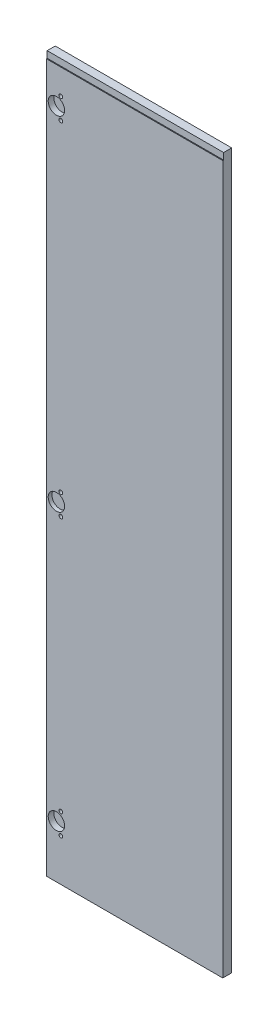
from build123d import *

# Parameters (mm, degrees)
SKIZZE1_W                                   = 376.5
SKIZZE1_H                                   = 1524.6
AUFSATZ_LINEAR_AUSTRAGEN1_DEPTH             = 19
SKIZZE5_R                                   = 17.5
SCHNITT_LINEAR_AUSTRAGEN1_TOPFBAND_DEPTH    = 12
F_8_0_8_DURCHMESSER_BOHRUNG1_TOPFBAND_D     = 8
F_8_0_8_DURCHMESSER_BOHRUNG1_TOPFBAND_DEPTH = 7
F_8_0_8_DURCHMESSER_BOHRUNG1_TOPFBAND_TIP   = 2.403442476
SKIZZE8_W                                   = 1.8
SKIZZE8_H                                   = 14
SCHNITT_LINEAR_AUSTRAGEN2_DEPTH             = 851.420213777
SKIZZE9_R                                   = 17.5
SCHNITT_LINEAR_AUSTRAGEN3_TOPFB_3OH_DEPTH   = 8
F_8_0_8_BOHRUNG2_TOPFB_3OH_D                = 8
F_8_0_8_BOHRUNG2_TOPFB_3OH_DEPTH            = 7
F_8_0_8_BOHRUNG2_TOPFB_3OH_TIP              = 2.403442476


with BuildPart() as part:
    # Skizze1 → Aufsatz-Linear austragen1 (new body)
    with BuildSketch(Plane.XY):
        Rectangle(SKIZZE1_W, SKIZZE1_H)
    extrude(amount=AUFSATZ_LINEAR_AUSTRAGEN1_DEPTH)

    # Skizze5 → Schnitt-Linear austragen1 Topfband (cut)
    with BuildSketch(Plane.XY.offset(19)):
        with Locations((-166.75, 672)):
            Circle(SKIZZE5_R)
        with Locations((-166.75, -649.8)):
            Circle(SKIZZE5_R)
    extrude(amount=-SCHNITT_LINEAR_AUSTRAGEN1_TOPFBAND_DEPTH, mode=Mode.SUBTRACT)

    # 8.0 _8_ Durchmesser Bohrung1 Topfband
    with Locations(Plane.XY.offset(19)):
        with Locations((-157.25, 694.5), (-157.25, 649.5), (-157.25, -627.3), (-157.25, -672.3)):
            Hole(F_8_0_8_DURCHMESSER_BOHRUNG1_TOPFBAND_D / 2, depth=F_8_0_8_DURCHMESSER_BOHRUNG1_TOPFBAND_DEPTH)
            with Locations((0, 0, -(F_8_0_8_DURCHMESSER_BOHRUNG1_TOPFBAND_DEPTH + F_8_0_8_DURCHMESSER_BOHRUNG1_TOPFBAND_TIP / 2))):  # 118° drill point
                Cone(0, F_8_0_8_DURCHMESSER_BOHRUNG1_TOPFBAND_D / 2, F_8_0_8_DURCHMESSER_BOHRUNG1_TOPFBAND_TIP, mode=Mode.SUBTRACT)

    # Skizze8 → Schnitt-Linear austragen2 (cut, through all)
    with BuildSketch(Plane.ZY.offset(188.25)):
        with Locations((18.1, 755.3)):
            Rectangle(SKIZZE8_W, SKIZZE8_H)
    extrude(amount=-SCHNITT_LINEAR_AUSTRAGEN2_DEPTH, mode=Mode.SUBTRACT)

    # Skizze9 → Schnitt-Linear austragen3 Topfb _3OH (cut)
    with BuildSketch(Plane.XY.offset(19)):
        with Locations((-166.75, -59.8)):
            Circle(SKIZZE9_R)
    extrude(amount=-SCHNITT_LINEAR_AUSTRAGEN3_TOPFB_3OH_DEPTH, mode=Mode.SUBTRACT)

    # 8.0 _8_ Bohrung2 Topfb _3OH
    with Locations(Plane.XY.offset(19)):
        with Locations((-157.25, -37.3), (-157.25, -82.3)):
            Hole(F_8_0_8_BOHRUNG2_TOPFB_3OH_D / 2, depth=F_8_0_8_BOHRUNG2_TOPFB_3OH_DEPTH)
            with Locations((0, 0, -(F_8_0_8_BOHRUNG2_TOPFB_3OH_DEPTH + F_8_0_8_BOHRUNG2_TOPFB_3OH_TIP / 2))):  # 118° drill point
                Cone(0, F_8_0_8_BOHRUNG2_TOPFB_3OH_D / 2, F_8_0_8_BOHRUNG2_TOPFB_3OH_TIP, mode=Mode.SUBTRACT)


solid = part.part
